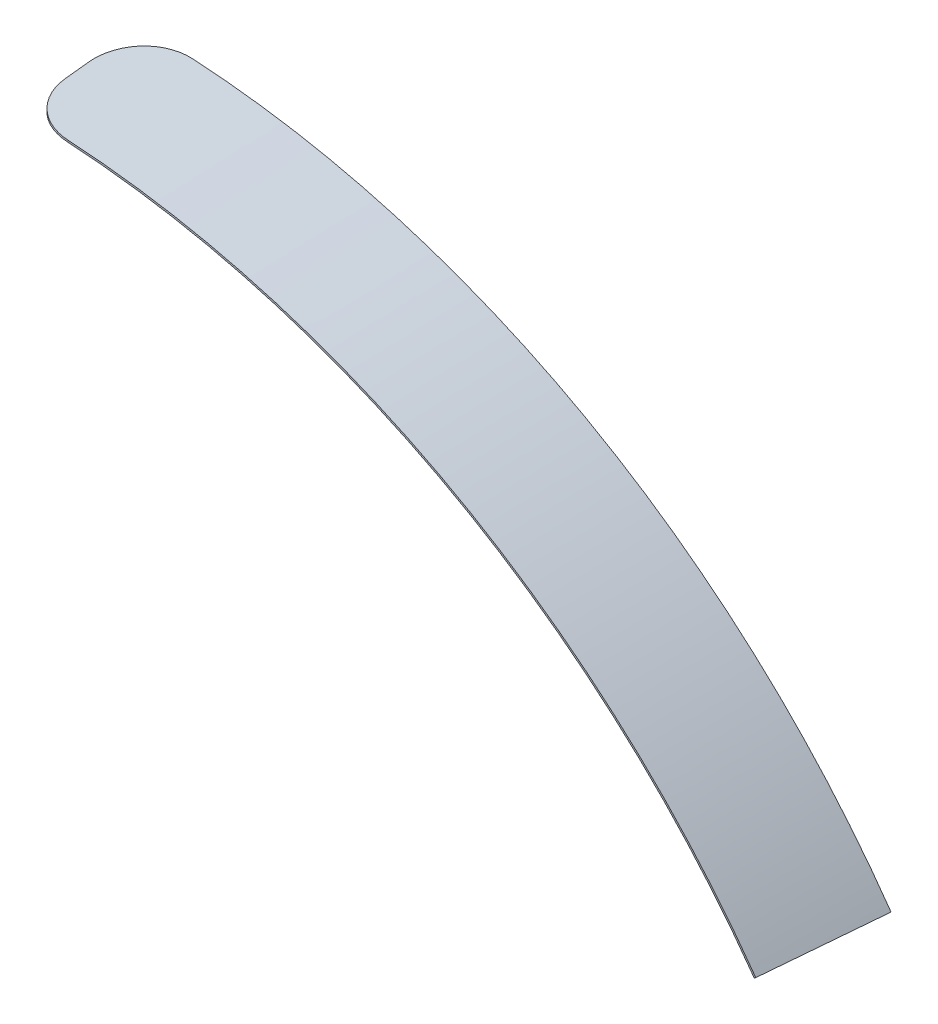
ISO-10303-21;
HEADER;
FILE_DESCRIPTION(('STEP AP214'),'2;1');
FILE_NAME('part.step','',(''),(''),'','','');
FILE_SCHEMA(('AUTOMOTIVE_DESIGN { 1 0 10303 214 1 1 1 1 }'));
ENDSEC;
DATA;
#1=APPLICATION_CONTEXT('core data for automotive mechanical design processes');
#2=APPLICATION_PROTOCOL_DEFINITION('international standard','automotive_design',2000,#1);
#3=PRODUCT_CONTEXT('',#1,'mechanical');
#4=PRODUCT('Part','Part','',(#3));
#5=PRODUCT_RELATED_PRODUCT_CATEGORY('part','',(#4));
#6=PRODUCT_DEFINITION_FORMATION('','',#4);
#7=PRODUCT_DEFINITION_CONTEXT('part definition',#1,'design');
#8=PRODUCT_DEFINITION('design','',#6,#7);
#9=PRODUCT_DEFINITION_SHAPE('','',#8);
#10=(LENGTH_UNIT() NAMED_UNIT(*) SI_UNIT(.MILLI.,.METRE.));
#11=(NAMED_UNIT(*) PLANE_ANGLE_UNIT() SI_UNIT($,.RADIAN.));
#12=(NAMED_UNIT(*) SI_UNIT($,.STERADIAN.) SOLID_ANGLE_UNIT());
#13=UNCERTAINTY_MEASURE_WITH_UNIT(LENGTH_MEASURE(1.E-05),#10,'distance_accuracy_value','');
#14=(GEOMETRIC_REPRESENTATION_CONTEXT(3) GLOBAL_UNCERTAINTY_ASSIGNED_CONTEXT((#13)) GLOBAL_UNIT_ASSIGNED_CONTEXT((#10,
#11,#12)) REPRESENTATION_CONTEXT('',''));
#15=CARTESIAN_POINT('',(0.,0.,0.));
#16=DIRECTION('',(0.,0.,1.));
#17=DIRECTION('',(1.,0.,0.));
#18=AXIS2_PLACEMENT_3D('',#15,#16,#17);
#19=CARTESIAN_POINT('',(0.,0.,0.));
#20=DIRECTION('',(0.,0.,1.));
#21=DIRECTION('',(1.,0.,0.));
#22=AXIS2_PLACEMENT_3D('',#19,#20,#21);
#23=CONICAL_SURFACE('',#22,179.,0.05235987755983);
#24=CARTESIAN_POINT('',(0.,0.,25.));
#25=DIRECTION('',(0.,0.,1.));
#26=DIRECTION('',(1.,0.,0.));
#27=AXIS2_PLACEMENT_3D('',#24,#25,#26);
#28=CIRCLE('',#27,180.310194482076);
#29=CARTESIAN_POINT('',(10.7998401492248,179.986470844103,25.));
#30=VERTEX_POINT('',#29);
#31=CARTESIAN_POINT('',(146.946068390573,104.492196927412,25.));
#32=VERTEX_POINT('',#31);
#33=EDGE_CURVE('E108',#30,#32,#28,.F.);
#34=ORIENTED_EDGE('',*,*,#33,.F.);
#35=CARTESIAN_POINT('',(10.7998401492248,179.986470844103,25.));
#36=CARTESIAN_POINT('',(10.5204700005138,180.003242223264,25.0000308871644));
#37=CARTESIAN_POINT('',(10.2410246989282,180.018734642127,24.9882940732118));
#38=CARTESIAN_POINT('',(9.68397258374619,180.047098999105,24.9414685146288));
#39=CARTESIAN_POINT('',(9.40636570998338,180.05997102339,24.9063805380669));
#40=CARTESIAN_POINT('',(8.85516939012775,180.083024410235,24.8130714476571));
#41=CARTESIAN_POINT('',(8.5815770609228,180.093207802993,24.7548678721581));
#42=CARTESIAN_POINT('',(8.04015184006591,180.110892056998,24.6157283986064));
#43=CARTESIAN_POINT('',(7.77231884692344,180.118392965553,24.5347929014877));
#44=CARTESIAN_POINT('',(7.24417414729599,180.130751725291,24.3506947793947));
#45=CARTESIAN_POINT('',(6.98386669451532,180.135608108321,24.2475198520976));
#46=CARTESIAN_POINT('',(6.4727833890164,180.142749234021,24.0196928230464));
#47=CARTESIAN_POINT('',(6.22200774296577,180.145033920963,23.8950402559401));
#48=CARTESIAN_POINT('',(5.73183918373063,180.147145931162,23.6251737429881));
#49=CARTESIAN_POINT('',(5.49244369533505,180.14697381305,23.47996447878));
#50=CARTESIAN_POINT('',(5.02667819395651,180.144320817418,23.1699972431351));
#51=CARTESIAN_POINT('',(4.80030809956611,180.141839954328,23.0052393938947));
#52=CARTESIAN_POINT('',(4.36230761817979,180.13474572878,22.6574367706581));
#53=CARTESIAN_POINT('',(4.15066973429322,180.130133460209,22.4744014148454));
#54=CARTESIAN_POINT('',(3.74349670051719,180.11897224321,22.0912736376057));
#55=CARTESIAN_POINT('',(3.54796159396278,180.112423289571,21.8911811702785));
#56=CARTESIAN_POINT('',(3.17430571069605,180.097596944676,21.4752911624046));
#57=CARTESIAN_POINT('',(2.99619058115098,180.089318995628,21.2594885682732));
#58=CARTESIAN_POINT('',(2.65869426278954,180.071255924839,20.8137669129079));
#59=CARTESIAN_POINT('',(2.49931272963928,180.061470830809,20.583848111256));
#60=CARTESIAN_POINT('',(2.19985936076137,180.040579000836,20.1106749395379));
#61=CARTESIAN_POINT('',(2.05985790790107,180.029467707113,19.867376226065));
#62=CARTESIAN_POINT('',(1.80081588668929,180.006173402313,19.3699203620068));
#63=CARTESIAN_POINT('',(1.68177496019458,179.993990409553,19.115763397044));
#64=CARTESIAN_POINT('',(1.46556192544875,179.968775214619,18.598575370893));
#65=CARTESIAN_POINT('',(1.36837357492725,179.955743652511,18.3355510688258));
#66=CARTESIAN_POINT('',(1.19645415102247,179.929026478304,17.8023954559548));
#67=CARTESIAN_POINT('',(1.121715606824,179.915341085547,17.5322665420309));
#68=CARTESIAN_POINT('',(0.992277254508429,179.886855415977,16.9741893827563));
#69=CARTESIAN_POINT('',(0.938653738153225,179.87203279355,16.6859920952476));
#70=CARTESIAN_POINT('',(0.856941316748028,179.842069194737,16.106534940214));
#71=CARTESIAN_POINT('',(0.828807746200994,179.826928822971,15.8152813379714));
#72=CARTESIAN_POINT('',(0.813544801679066,179.811704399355,15.5233595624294));
#73=B_SPLINE_CURVE_WITH_KNOTS('',3,(#35,#36,#37,#38,#39,#40,#41,#42,#43,#44,#45,#46,#47,#48,#49,
#50,#51,#52,#53,#54,#55,#56,#57,#58,#59,#60,#61,#62,#63,#64,#65,#66,#67,#68,#69,#70,#71,#72),
.UNSPECIFIED.,.F.,.F.,(4,2,2,2,2,2,2,2,2,2,2,2,2,2,2,2,2,2,4),(0.,0.839368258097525,
1.678708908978,2.51741394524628,3.35610418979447,4.19525957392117,5.03443314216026,
5.87341590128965,6.7123934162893,7.55094082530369,8.38949049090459,9.22831110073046,
10.0671162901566,10.9088920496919,11.7506534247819,12.591787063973,13.4326404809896,
14.312059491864,15.1899345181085),.UNSPECIFIED.);
#74=CARTESIAN_POINT('',(0.813544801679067,179.811704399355,15.5233595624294));
#75=VERTEX_POINT('',#74);
#76=EDGE_CURVE('E40',#30,#75,#73,.T.);
#77=ORIENTED_EDGE('',*,*,#76,.T.);
#78=CARTESIAN_POINT('',(1.31019448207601,180.305434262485,25.));
#79=CARTESIAN_POINT('',(1.09182658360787,180.088650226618,20.8332922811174));
#80=CARTESIAN_POINT('',(0.873459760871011,179.871472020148,16.6666050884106));
#81=CARTESIAN_POINT('',(0.436728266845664,179.436327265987,8.33327175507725));
#82=CARTESIAN_POINT('',(0.218363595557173,179.218360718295,4.16662561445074));
#83=CARTESIAN_POINT('',(0.,179.,0.));
#84=B_SPLINE_CURVE_WITH_KNOTS('',3,(#78,#79,#80,#81,#82,#83),.UNSPECIFIED.,.F.,.F.,(4,2,4),(0.,
12.534161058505,25.0683221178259),.UNSPECIFIED.);
#85=CARTESIAN_POINT('',(0.551505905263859,179.550658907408,10.5233595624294));
#86=VERTEX_POINT('',#85);
#87=EDGE_CURVE('E116',#75,#86,#84,.T.);
#88=ORIENTED_EDGE('',*,*,#87,.T.);
#89=CARTESIAN_POINT('',(0.551505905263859,179.550658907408,10.5233595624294));
#90=CARTESIAN_POINT('',(0.53673599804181,179.535959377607,10.2421085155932));
#91=CARTESIAN_POINT('',(0.533907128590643,179.521198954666,9.9602392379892));
#92=CARTESIAN_POINT('',(0.552017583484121,179.491643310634,9.397279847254));
#93=CARTESIAN_POINT('',(0.572955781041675,179.476848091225,9.11618969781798));
#94=CARTESIAN_POINT('',(0.638459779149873,179.447319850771,8.55699338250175));
#95=CARTESIAN_POINT('',(0.683007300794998,179.432586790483,8.27888507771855));
#96=CARTESIAN_POINT('',(0.795392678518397,179.403222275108,7.72741323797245));
#97=CARTESIAN_POINT('',(0.863230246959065,179.388590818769,7.45404964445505));
#98=CARTESIAN_POINT('',(1.02175495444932,179.359448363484,6.91388079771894));
#99=CARTESIAN_POINT('',(1.11245300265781,179.344937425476,6.64707874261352));
#100=CARTESIAN_POINT('',(1.31603898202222,179.316043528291,6.12206589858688));
#101=CARTESIAN_POINT('',(1.42892737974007,179.301660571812,5.86385529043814));
#102=CARTESIAN_POINT('',(1.67606930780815,179.27300420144,5.35791444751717));
#103=CARTESIAN_POINT('',(1.81031942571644,179.258730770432,5.11018254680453));
#104=CARTESIAN_POINT('',(2.0992399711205,179.23025187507,4.62692487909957));
#105=CARTESIAN_POINT('',(2.25391029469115,179.216046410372,4.39139904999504));
#106=CARTESIAN_POINT('',(2.58255631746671,179.187651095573,3.93425020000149));
#107=CARTESIAN_POINT('',(2.7565306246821,179.173461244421,3.7126261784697));
#108=CARTESIAN_POINT('',(3.12255156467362,179.145033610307,3.28484444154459));
#109=CARTESIAN_POINT('',(3.31459819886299,179.13079582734,3.07868672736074));
#110=CARTESIAN_POINT('',(3.71541317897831,179.102204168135,2.68328778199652));
#111=CARTESIAN_POINT('',(3.92418329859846,179.087850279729,2.49404834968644));
#112=CARTESIAN_POINT('',(4.35693346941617,179.058962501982,2.13386217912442));
#113=CARTESIAN_POINT('',(4.58091337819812,179.044428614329,1.96291526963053));
#114=CARTESIAN_POINT('',(5.04250161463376,179.015120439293,1.64051798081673));
#115=CARTESIAN_POINT('',(5.2801109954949,179.000346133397,1.48906911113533));
#116=CARTESIAN_POINT('',(5.76723985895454,178.970510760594,1.20676466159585));
#117=CARTESIAN_POINT('',(6.01675905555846,178.955449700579,1.0759085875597));
#118=CARTESIAN_POINT('',(6.52588356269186,178.925011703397,0.835736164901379));
#119=CARTESIAN_POINT('',(6.785487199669,178.909634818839,0.726416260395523));
#120=CARTESIAN_POINT('',(7.3129494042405,178.878552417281,0.530074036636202));
#121=CARTESIAN_POINT('',(7.58080682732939,178.86284694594,0.443048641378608));
#122=CARTESIAN_POINT('',(8.07022828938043,178.83420113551,0.306573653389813));
#123=CARTESIAN_POINT('',(8.29068626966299,178.821315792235,0.253109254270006));
#124=CARTESIAN_POINT('',(8.73469338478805,178.795360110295,0.161291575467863));
#125=CARTESIAN_POINT('',(8.95824207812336,178.782289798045,0.122936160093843));
#126=CARTESIAN_POINT('',(9.40725659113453,178.756002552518,0.0615311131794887));
#127=CARTESIAN_POINT('',(9.63272092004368,178.742785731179,0.0384705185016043));
#128=CARTESIAN_POINT('',(10.0847235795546,178.71623961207,0.00769759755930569));
#129=CARTESIAN_POINT('',(10.3112620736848,178.702910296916,-1.23113012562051E-05));
#130=CARTESIAN_POINT('',(10.5378012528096,178.68954850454,0.));
#131=B_SPLINE_CURVE_WITH_KNOTS('',3,(#89,#90,#91,#92,#93,#94,#95,#96,#97,#98,#99,#100,#101,#102,
#103,#104,#105,#106,#107,#108,#109,#110,#111,#112,#113,#114,#115,#116,#117,#118,#119,#120,#121,
#122,#123,#124,#125,#126,#127,#128,#129,#130),.UNSPECIFIED.,.F.,.F.,(4,2,2,2,2,2,2,2,2,2,2,2,2,
2,2,2,2,2,2,2,4),(0.,0.845807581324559,1.69157506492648,2.53668868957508,3.38179187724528,
4.22729911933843,5.07282414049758,5.91821422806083,6.7636000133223,7.60892487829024,
8.45424980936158,9.29966451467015,10.1450713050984,10.9905435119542,11.8359954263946,
12.681307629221,13.5265031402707,14.2076443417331,14.8886892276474,15.5692454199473,
16.2499087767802),.UNSPECIFIED.);
#132=CARTESIAN_POINT('',(10.5378012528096,178.68954850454,0.));
#133=VERTEX_POINT('',#132);
#134=EDGE_CURVE('E47',#86,#133,#131,.T.);
#135=ORIENTED_EDGE('',*,*,#134,.T.);
#136=CARTESIAN_POINT('',(0.,0.,0.));
#137=DIRECTION('',(0.,0.,1.));
#138=DIRECTION('',(1.,0.,0.));
#139=AXIS2_PLACEMENT_3D('',#136,#137,#138);
#140=CIRCLE('',#139,179.);
#141=CARTESIAN_POINT('',(146.62821592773,102.670182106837,0.));
#142=VERTEX_POINT('',#141);
#143=EDGE_CURVE('E85',#133,#142,#140,.F.);
#144=ORIENTED_EDGE('',*,*,#143,.T.);
#145=CARTESIAN_POINT('',(146.946068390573,104.492196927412,25.));
#146=CARTESIAN_POINT('',(146.893739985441,104.188978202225,20.8332922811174));
#147=CARTESIAN_POINT('',(146.841088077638,103.885534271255,16.6666050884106));
#148=CARTESIAN_POINT('',(146.735137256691,103.27819599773,8.33327175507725));
#149=CARTESIAN_POINT('',(146.681838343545,102.974301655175,4.16662561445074));
#150=CARTESIAN_POINT('',(146.62821592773,102.670182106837,0.));
#151=B_SPLINE_CURVE_WITH_KNOTS('',3,(#145,#146,#147,#148,#149,#150),.UNSPECIFIED.,.F.,.F.,(4,2,
4),(0.,12.534161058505,25.0683221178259),.UNSPECIFIED.);
#152=EDGE_CURVE('E87',#32,#142,#151,.T.);
#153=ORIENTED_EDGE('',*,*,#152,.F.);
#154=EDGE_LOOP('',(#34,#77,#88,#135,#144,#153));
#155=FACE_BOUND('',#154,.T.);
#156=ADVANCED_FACE('F31',(#155),#23,.F.);
#157=CARTESIAN_POINT('',(149.085672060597,104.39091141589,0.));
#158=DIRECTION('',(0.572790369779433,-0.818029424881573,0.0523359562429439));
#159=DIRECTION('',(0.819152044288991,0.573576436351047,0.));
#160=AXIS2_PLACEMENT_3D('',#157,#158,#159);
#161=PLANE('',#160);
#162=DIRECTION('',(-0.819152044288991,-0.573576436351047,0.));
#163=VECTOR('',#162,1.);
#164=CARTESIAN_POINT('',(149.085672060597,104.39091141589,0.));
#165=LINE('',#164,#163);
#166=CARTESIAN_POINT('',(149.085672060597,104.39091141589,0.));
#167=VERTEX_POINT('',#166);
#168=EDGE_CURVE('E92',#167,#142,#165,.T.);
#169=ORIENTED_EDGE('',*,*,#168,.F.);
#170=CARTESIAN_POINT('',(147.257035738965,104.709938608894,25.));
#171=CARTESIAN_POINT('',(147.56245629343,104.657223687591,20.8333748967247));
#172=CARTESIAN_POINT('',(147.867552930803,104.604280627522,16.6667290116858));
#173=CARTESIAN_POINT('',(148.477098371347,104.497938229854,8.33339567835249));
#174=CARTESIAN_POINT('',(148.781547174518,104.444538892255,4.16670823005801));
#175=CARTESIAN_POINT('',(149.085672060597,104.39091141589,0.));
#176=B_SPLINE_CURVE_WITH_KNOTS('',3,(#170,#171,#172,#173,#174,#175),.UNSPECIFIED.,.F.,.F.,(4,2,
4),(0.,12.5344095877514,25.0688191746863),.UNSPECIFIED.);
#177=CARTESIAN_POINT('',(147.257035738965,104.709938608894,25.));
#178=VERTEX_POINT('',#177);
#179=EDGE_CURVE('E101',#178,#167,#176,.T.);
#180=ORIENTED_EDGE('',*,*,#179,.F.);
#181=DIRECTION('',(-0.819152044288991,-0.573576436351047,0.));
#182=VECTOR('',#181,1.);
#183=CARTESIAN_POINT('',(148.334175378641,105.464159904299,25.));
#184=LINE('',#183,#182);
#185=EDGE_CURVE('E99',#178,#32,#184,.T.);
#186=ORIENTED_EDGE('',*,*,#185,.T.);
#187=ORIENTED_EDGE('',*,*,#152,.T.);
#188=EDGE_LOOP('',(#169,#180,#186,#187));
#189=FACE_BOUND('',#188,.T.);
#190=ADVANCED_FACE('F96',(#189),#161,.T.);
#191=CARTESIAN_POINT('',(0.,0.,0.));
#192=DIRECTION('',(0.,0.,-1.));
#193=DIRECTION('',(-1.,0.,0.));
#194=AXIS2_PLACEMENT_3D('',#191,#192,#193);
#195=CONICAL_SURFACE('',#194,182.,0.05235987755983);
#196=CARTESIAN_POINT('',(1.31019448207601,180.685055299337,25.));
#197=CARTESIAN_POINT('',(1.09183091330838,180.905005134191,20.8333748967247));
#198=CARTESIAN_POINT('',(0.873466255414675,181.124558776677,16.6667290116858));
#199=CARTESIAN_POINT('',(0.436734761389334,181.562873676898,8.33339567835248));
#200=CARTESIAN_POINT('',(0.218367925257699,181.781634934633,4.16670823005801));
#201=CARTESIAN_POINT('',(0.,182.,0.));
#202=B_SPLINE_CURVE_WITH_KNOTS('',3,(#196,#197,#198,#199,#200,#201),.UNSPECIFIED.,.F.,.F.,(4,2,
4),(0.,12.5344095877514,25.0688191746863),.UNSPECIFIED.);
#203=CARTESIAN_POINT('',(0.813544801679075,181.184628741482,15.5233595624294));
#204=VERTEX_POINT('',#203);
#205=CARTESIAN_POINT('',(0.55150590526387,181.447655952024,10.5233595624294));
#206=VERTEX_POINT('',#205);
#207=EDGE_CURVE('E133',#204,#206,#202,.T.);
#208=ORIENTED_EDGE('',*,*,#207,.F.);
#209=CARTESIAN_POINT('',(0.813544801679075,181.184628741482,15.5233595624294));
#210=CARTESIAN_POINT('',(0.828254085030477,181.169818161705,15.804607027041));
#211=CARTESIAN_POINT('',(0.854903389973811,181.154994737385,16.0852237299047));
#212=CARTESIAN_POINT('',(0.931758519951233,181.125375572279,16.6432011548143));
#213=CARTESIAN_POINT('',(0.981963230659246,181.110579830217,16.9205620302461));
#214=CARTESIAN_POINT('',(1.10556214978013,181.081078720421,17.4698605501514));
#215=CARTESIAN_POINT('',(1.1789394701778,181.066373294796,17.7418019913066));
#216=CARTESIAN_POINT('',(1.34836303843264,181.037061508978,18.2785306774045));
#217=CARTESIAN_POINT('',(1.44440900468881,181.022455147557,18.5433180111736));
#218=CARTESIAN_POINT('',(1.65854196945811,180.993331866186,19.06398139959));
#219=CARTESIAN_POINT('',(1.77663965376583,180.978814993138,19.3198530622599));
#220=CARTESIAN_POINT('',(2.03400582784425,180.949853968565,19.8207289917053));
#221=CARTESIAN_POINT('',(2.17327476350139,180.935409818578,20.0657330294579));
#222=CARTESIAN_POINT('',(2.47195495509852,180.906557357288,20.543065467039));
#223=CARTESIAN_POINT('',(2.63136171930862,180.892149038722,20.7753966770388));
#224=CARTESIAN_POINT('',(2.96920312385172,180.863312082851,21.2257826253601));
#225=CARTESIAN_POINT('',(3.147637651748,180.848883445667,21.4438374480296));
#226=CARTESIAN_POINT('',(3.52223858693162,180.819946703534,21.864090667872));
#227=CARTESIAN_POINT('',(3.71840287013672,180.8054386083,22.0662909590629));
#228=CARTESIAN_POINT('',(4.1270802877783,180.776277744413,22.4534218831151));
#229=CARTESIAN_POINT('',(4.33959342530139,180.761624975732,22.6383525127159));
#230=CARTESIAN_POINT('',(4.77952181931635,180.732108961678,22.9896830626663));
#231=CARTESIAN_POINT('',(5.00694189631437,180.717245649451,23.1560769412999));
#232=CARTESIAN_POINT('',(5.47499130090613,180.687260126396,23.4690756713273));
#233=CARTESIAN_POINT('',(5.71562033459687,180.672137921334,23.6156809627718));
#234=CARTESIAN_POINT('',(6.20848402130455,180.641586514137,23.8881252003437));
#235=CARTESIAN_POINT('',(6.46072385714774,180.626157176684,24.0139547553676));
#236=CARTESIAN_POINT('',(6.97490004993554,180.594974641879,24.2438705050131));
#237=CARTESIAN_POINT('',(7.23683620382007,180.579221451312,24.3479571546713));
#238=CARTESIAN_POINT('',(7.76832109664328,180.547401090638,24.5335752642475));
#239=CARTESIAN_POINT('',(8.03786341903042,180.531334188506,24.6151251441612));
#240=CARTESIAN_POINT('',(8.58275005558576,180.498901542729,24.7551844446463));
#241=CARTESIAN_POINT('',(8.85809227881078,180.482535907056,24.8137020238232));
#242=CARTESIAN_POINT('',(9.4104745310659,180.449680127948,24.906939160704));
#243=CARTESIAN_POINT('',(9.68748293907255,180.433192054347,24.9418469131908));
#244=CARTESIAN_POINT('',(10.242942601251,180.400072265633,24.9883710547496));
#245=CARTESIAN_POINT('',(10.5213904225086,180.383440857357,25.0000286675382));
#246=CARTESIAN_POINT('',(10.7998401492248,180.366763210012,25.));
#247=B_SPLINE_CURVE_WITH_KNOTS('',3,(#209,#210,#211,#212,#213,#214,#215,#216,#217,#218,#219,
#220,#221,#222,#223,#224,#225,#226,#227,#228,#229,#230,#231,#232,#233,#234,#235,#236,#237,#238,
#239,#240,#241,#242,#243,#244,#245,#246),.UNSPECIFIED.,.F.,.F.,(4,2,2,2,2,2,2,2,2,2,2,2,2,2,2,2,
2,2,4),(0.,0.845804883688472,1.69156975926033,2.53671966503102,3.38185907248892,
4.22740908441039,5.07297690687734,5.9183564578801,6.76373101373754,7.60900442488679,
8.45427799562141,9.2998262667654,10.1453557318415,10.9912663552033,11.8371592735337,
12.6823587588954,13.527258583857,14.3653417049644,15.2019375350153),.UNSPECIFIED.);
#248=CARTESIAN_POINT('',(10.7998401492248,180.366763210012,25.));
#249=VERTEX_POINT('',#248);
#250=EDGE_CURVE('E151',#204,#249,#247,.T.);
#251=ORIENTED_EDGE('',*,*,#250,.T.);
#252=CARTESIAN_POINT('',(0.,0.,25.));
#253=DIRECTION('',(0.,0.,1.));
#254=DIRECTION('',(1.,0.,0.));
#255=AXIS2_PLACEMENT_3D('',#252,#253,#254);
#256=CIRCLE('',#255,180.689805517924);
#257=EDGE_CURVE('E139',#249,#178,#256,.F.);
#258=ORIENTED_EDGE('',*,*,#257,.T.);
#259=ORIENTED_EDGE('',*,*,#179,.T.);
#260=CARTESIAN_POINT('',(0.,0.,0.));
#261=DIRECTION('',(0.,0.,-1.));
#262=DIRECTION('',(-1.,0.,0.));
#263=AXIS2_PLACEMENT_3D('',#260,#261,#262);
#264=CIRCLE('',#263,182.);
#265=CARTESIAN_POINT('',(10.5378012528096,181.694674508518,0.));
#266=VERTEX_POINT('',#265);
#267=EDGE_CURVE('E105',#266,#167,#264,.T.);
#268=ORIENTED_EDGE('',*,*,#267,.F.);
#269=CARTESIAN_POINT('',(10.5378012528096,181.694674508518,0.));
#270=CARTESIAN_POINT('',(10.2583926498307,181.710887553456,-3.08981748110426E-05));
#271=CARTESIAN_POINT('',(9.97891192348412,181.72582744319,0.0117091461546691));
#272=CARTESIAN_POINT('',(9.42179582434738,181.753101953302,0.0585460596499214));
#273=CARTESIAN_POINT('',(9.14416038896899,181.765436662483,0.0936421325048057));
#274=CARTESIAN_POINT('',(8.59292869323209,181.787434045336,0.186968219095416));
#275=CARTESIAN_POINT('',(8.31932934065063,181.79709887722,0.245179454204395));
#276=CARTESIAN_POINT('',(7.77789610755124,181.813768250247,0.384333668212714));
#277=CARTESIAN_POINT('',(7.51006212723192,181.820772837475,0.465276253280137));
#278=CARTESIAN_POINT('',(6.98192413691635,181.832163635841,0.6493855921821));
#279=CARTESIAN_POINT('',(6.72162428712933,181.836548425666,0.752564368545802));
#280=CARTESIAN_POINT('',(6.21056021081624,181.842773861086,0.980395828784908));
#281=CARTESIAN_POINT('',(5.95979619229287,181.844614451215,1.10504898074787));
#282=CARTESIAN_POINT('',(5.46963811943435,181.845867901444,1.37492136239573));
#283=CARTESIAN_POINT('',(5.23024220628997,181.845281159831,1.52013721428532));
#284=CARTESIAN_POINT('',(4.76447882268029,181.841829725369,1.83011606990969));
#285=CARTESIAN_POINT('',(4.53811128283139,181.838965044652,1.99487896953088));
#286=CARTESIAN_POINT('',(4.10007518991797,181.831134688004,2.34272394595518));
#287=CARTESIAN_POINT('',(3.88840199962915,181.826169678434,2.52580019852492));
#288=CARTESIAN_POINT('',(3.48116618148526,181.814335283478,2.90901449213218));
#289=CARTESIAN_POINT('',(3.28560359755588,181.8074658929,3.10915257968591));
#290=CARTESIAN_POINT('',(2.91193999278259,181.792033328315,3.52509405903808));
#291=CARTESIAN_POINT('',(2.73384093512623,181.783469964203,3.74089920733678));
#292=CARTESIAN_POINT('',(2.39637432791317,181.764870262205,4.18662690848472));
#293=CARTESIAN_POINT('',(2.23700667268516,181.754833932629,4.41654938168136));
#294=CARTESIAN_POINT('',(1.9376142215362,181.733475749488,4.88967572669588));
#295=CARTESIAN_POINT('',(1.79765536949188,181.722149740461,5.13292114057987));
#296=CARTESIAN_POINT('',(1.53868894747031,181.69846138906,5.6302656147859));
#297=CARTESIAN_POINT('',(1.41968095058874,181.686099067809,5.8843644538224));
#298=CARTESIAN_POINT('',(1.2034546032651,181.660552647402,6.40159228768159));
#299=CARTESIAN_POINT('',(1.1062337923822,181.647368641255,6.66472025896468));
#300=CARTESIAN_POINT('',(0.934248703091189,181.620377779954,7.19816264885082));
#301=CARTESIAN_POINT('',(0.859481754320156,181.60657099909,7.46847620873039));
#302=CARTESIAN_POINT('',(0.743439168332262,181.580849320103,7.96897676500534));
#303=CARTESIAN_POINT('',(0.698661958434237,181.569001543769,8.1983628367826));
#304=CARTESIAN_POINT('',(0.625280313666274,181.545092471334,8.65967630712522));
#305=CARTESIAN_POINT('',(0.596673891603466,181.533031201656,8.891603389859));
#306=CARTESIAN_POINT('',(0.55578311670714,181.508784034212,9.35674780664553));
#307=CARTESIAN_POINT('',(0.543489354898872,181.496598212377,9.58996431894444));
#308=CARTESIAN_POINT('',(0.535234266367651,181.47215995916,10.0567158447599));
#309=CARTESIAN_POINT('',(0.539275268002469,181.45990751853,10.2902508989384));
#310=CARTESIAN_POINT('',(0.551505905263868,181.447655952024,10.5233595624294));
#311=B_SPLINE_CURVE_WITH_KNOTS('',3,(#269,#270,#271,#272,#273,#274,#275,#276,#277,#278,#279,
#280,#281,#282,#283,#284,#285,#286,#287,#288,#289,#290,#291,#292,#293,#294,#295,#296,#297,#298,
#299,#300,#301,#302,#303,#304,#305,#306,#307,#308,#309,#310),.UNSPECIFIED.,.F.,.F.,(4,2,2,2,2,2,
2,2,2,2,2,2,2,2,2,2,2,2,2,2,4),(0.,0.839384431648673,1.67874024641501,2.51741556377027,
3.35607635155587,4.19519172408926,5.03432538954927,5.87332137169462,6.71231288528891,
7.55103841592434,8.38976623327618,9.22858822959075,10.0674054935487,10.9090063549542,
11.7505900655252,12.5920786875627,13.4334671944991,14.1349621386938,14.8363708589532,
15.5373748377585,16.2384787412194),.UNSPECIFIED.);
#312=EDGE_CURVE('E145',#266,#206,#311,.T.);
#313=ORIENTED_EDGE('',*,*,#312,.T.);
#314=EDGE_LOOP('',(#208,#251,#258,#259,#268,#313));
#315=FACE_BOUND('',#314,.T.);
#316=ADVANCED_FACE('F33',(#315),#195,.T.);
#317=CARTESIAN_POINT('',(0.,179.,0.));
#318=DIRECTION('',(-0.998629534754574,0.,0.0523359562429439));
#319=DIRECTION('',(0.052335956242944,0.,0.998629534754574));
#320=AXIS2_PLACEMENT_3D('',#317,#318,#319);
#321=PLANE('',#320);
#322=ORIENTED_EDGE('',*,*,#87,.F.);
#323=DIRECTION('',(0.,1.,0.));
#324=VECTOR('',#323,1.);
#325=CARTESIAN_POINT('',(0.813544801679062,179.,15.5233595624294));
#326=LINE('',#325,#324);
#327=EDGE_CURVE('E142',#75,#204,#326,.T.);
#328=ORIENTED_EDGE('',*,*,#327,.T.);
#329=ORIENTED_EDGE('',*,*,#207,.T.);
#330=DIRECTION('',(0.,1.,0.));
#331=VECTOR('',#330,1.);
#332=CARTESIAN_POINT('',(0.551505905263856,179.,10.5233595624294));
#333=LINE('',#332,#331);
#334=EDGE_CURVE('E100',#206,#86,#333,.F.);
#335=ORIENTED_EDGE('',*,*,#334,.T.);
#336=EDGE_LOOP('',(#322,#328,#329,#335));
#337=FACE_BOUND('',#336,.T.);
#338=ADVANCED_FACE('F125',(#337),#321,.T.);
#339=CARTESIAN_POINT('',(0.,0.,25.));
#340=DIRECTION('',(0.,0.,1.));
#341=DIRECTION('',(1.,0.,0.));
#342=AXIS2_PLACEMENT_3D('',#339,#340,#341);
#343=PLANE('',#342);
#344=ORIENTED_EDGE('',*,*,#257,.F.);
#345=DIRECTION('',(0.,1.,0.));
#346=VECTOR('',#345,1.);
#347=CARTESIAN_POINT('',(10.7998401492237,0.,25.));
#348=LINE('',#347,#346);
#349=EDGE_CURVE('E55',#249,#30,#348,.F.);
#350=ORIENTED_EDGE('',*,*,#349,.T.);
#351=ORIENTED_EDGE('',*,*,#33,.T.);
#352=ORIENTED_EDGE('',*,*,#185,.F.);
#353=EDGE_LOOP('',(#344,#350,#351,#352));
#354=FACE_BOUND('',#353,.T.);
#355=ADVANCED_FACE('F181',(#354),#343,.T.);
#356=CARTESIAN_POINT('',(0.,0.,0.));
#357=DIRECTION('',(0.,0.,1.));
#358=DIRECTION('',(1.,0.,0.));
#359=AXIS2_PLACEMENT_3D('',#356,#357,#358);
#360=PLANE('',#359);
#361=ORIENTED_EDGE('',*,*,#143,.F.);
#362=DIRECTION('',(0.,1.,0.));
#363=VECTOR('',#362,1.);
#364=CARTESIAN_POINT('',(10.5378012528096,182.,0.));
#365=LINE('',#364,#363);
#366=EDGE_CURVE('E11',#133,#266,#365,.T.);
#367=ORIENTED_EDGE('',*,*,#366,.T.);
#368=ORIENTED_EDGE('',*,*,#267,.T.);
#369=ORIENTED_EDGE('',*,*,#168,.T.);
#370=EDGE_LOOP('',(#361,#367,#368,#369));
#371=FACE_BOUND('',#370,.T.);
#372=ADVANCED_FACE('F103',(#371),#360,.F.);
#373=CARTESIAN_POINT('',(10.7998401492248,179.,15.));
#374=DIRECTION('',(0.,1.,0.));
#375=DIRECTION('',(-1.,0.,0.));
#376=AXIS2_PLACEMENT_3D('',#373,#374,#375);
#377=CYLINDRICAL_SURFACE('',#376,10.);
#378=ORIENTED_EDGE('',*,*,#76,.F.);
#379=ORIENTED_EDGE('',*,*,#349,.F.);
#380=ORIENTED_EDGE('',*,*,#250,.F.);
#381=ORIENTED_EDGE('',*,*,#327,.F.);
#382=EDGE_LOOP('',(#378,#379,#380,#381));
#383=FACE_BOUND('',#382,.T.);
#384=ADVANCED_FACE('F160',(#383),#377,.T.);
#385=CARTESIAN_POINT('',(10.5378012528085,0.,10.));
#386=DIRECTION('',(0.,-1.,0.));
#387=DIRECTION('',(1.,0.,0.));
#388=AXIS2_PLACEMENT_3D('',#385,#386,#387);
#389=CYLINDRICAL_SURFACE('',#388,10.);
#390=ORIENTED_EDGE('',*,*,#134,.F.);
#391=ORIENTED_EDGE('',*,*,#334,.F.);
#392=ORIENTED_EDGE('',*,*,#312,.F.);
#393=ORIENTED_EDGE('',*,*,#366,.F.);
#394=EDGE_LOOP('',(#390,#391,#392,#393));
#395=FACE_BOUND('',#394,.T.);
#396=ADVANCED_FACE('F157',(#395),#389,.T.);
#397=CLOSED_SHELL('',(#156,#190,#316,#338,#355,#372,#384,#396));
#398=MANIFOLD_SOLID_BREP('B2',#397);
#399=ADVANCED_BREP_SHAPE_REPRESENTATION('',(#18,#398),#14);
#400=SHAPE_DEFINITION_REPRESENTATION(#9,#399);
ENDSEC;
END-ISO-10303-21;
